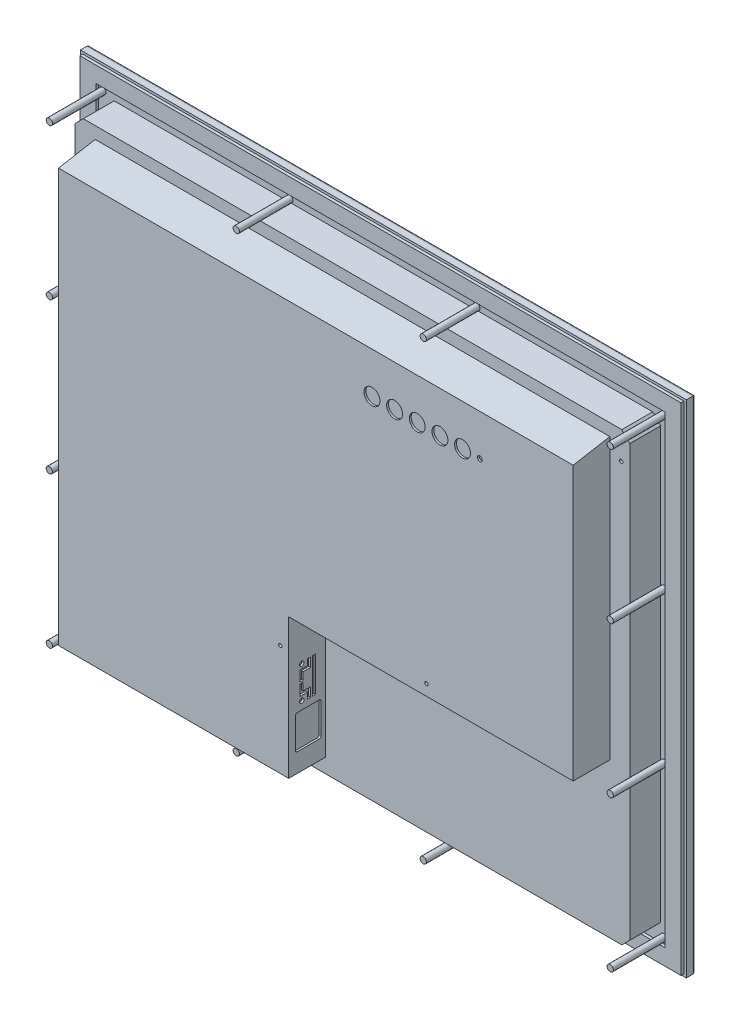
from build123d import *

# Parameters (mm, degrees)
SKETCH1_W                                        = 482.6
SKETCH1_H                                        = 398.78
BEZEL_DEPTH                                      = 7.112
BEZEL_RADIUS_R                                   = 2
SKETCH2_W                                        = 380.8476
SKETCH2_H                                        = 305.6128
WINDOW_DEPTH                                     = 2.35
SKETCH3_W                                        = 478.79
SKETCH3_H                                        = 394.97
SKETCH3_W_2                                      = 453.39
SKETCH3_H_2                                      = 369.57
GASKET_DEPTH                                     = 2.3
SKETCH5_R                                        = 2.5
PANEL_FRAME_STUDS_DEPTH                          = 42.7
BODY_DEPTH                                       = 24.5618
REAR_COVER_DEPTH                                 = 29.21
REAR_COVER_SLOPE_ANGLE                           = 10
SKETCH10_R                                       = 1.5875
VIDEO_TOUCH_INTERFACE_DEPTH                      = 1.524
SKETCH11_R                                       = 1.7907
SKETCH11_W                                       = 2.54
SKETCH11_H                                       = 27.94
POWER_AC_AND_DC_DEPTH                            = 1.524
SKETCH12_R                                       = 6.35
SKETCH12_R_2                                     = 1.9812
CONTROLS_BUTTONS_DEPTH                           = 1.524
F_6_32_ACCESSORY_BRACKET_HOLES_IN_REAR_2_COUNT   = 2
F_6_32_ACCESSORY_BRACKET_HOLES_IN_REAR_2_PITCH   = 120.662672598
F_6_32_ACCESSORY_BRACKET_HOLES_IN_FRAME_AT_COUNT = 2
F_6_32_ACCESSORY_BRACKET_HOLES_IN_FRAME_AT_PITCH = 428.0408
F_6_32_ACCESSORY_BRACKET_HOLES_IN_FRAM_2_COUNT   = 2
F_6_32_ACCESSORY_BRACKET_HOLES_IN_FRAM_2_PITCH   = 529.181678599


with BuildPart() as part:
    # Sketch1 → Bezel (new body)
    with BuildSketch(Plane.XY):
        Rectangle(SKETCH1_W, SKETCH1_H)
    extrude(amount=-BEZEL_DEPTH)

    # Bezel Radius
    bezel_radius_edges = [part.edges().sort_by_distance(p)[0] for p in [
        (241.3, 0, -7.112),
        (0, 199.39, -7.112),
        (-241.3, 0, -7.112),
        (0, -199.39, -7.112),
    ]]
    fillet(bezel_radius_edges, radius=BEZEL_RADIUS_R)

    # Sketch2 → Window (cut)
    with BuildSketch(Plane(origin=(0, 0, -7.112), x_dir=(-1, 0, 0), z_dir=(0, 0, -1))):
        with Locations((0, 2.3114)):
            Rectangle(SKETCH2_W, SKETCH2_H)
    extrude(amount=-WINDOW_DEPTH, mode=Mode.SUBTRACT)

    # Sketch3 → Gasket (add)
    with BuildSketch(Plane.XY):
        Rectangle(SKETCH3_W, SKETCH3_H)
        Rectangle(SKETCH3_W_2, SKETCH3_H_2, mode=Mode.SUBTRACT)
    extrude(amount=GASKET_DEPTH)

    # Sketch5 → Panel Frame Studs (add)
    with BuildSketch(Plane.XY):
        with Locations(Location((-223.3168, 180.1876, 0), (0, 0, 180))):
            Circle(SKETCH5_R)
        with Locations(Location((-223.3168, -180.1876, 0), (0, 0, 180))):
            Circle(SKETCH5_R)
        with Locations(Location((-74.422, 180.1876, 0), (0, 0, 180))):
            Circle(SKETCH5_R)
        with Locations(Location((-74.422, -180.1876, 0), (0, 0, 180))):
            Circle(SKETCH5_R)
        with Locations(Location((-223.3168, 60.0456, 0), (0, 0, 180))):
            Circle(SKETCH5_R)
        with Locations(Location((74.4728, 180.1876, 0), (0, 0, 180))):
            Circle(SKETCH5_R)
        with Locations(Location((74.4728, -180.1876, 0), (0, 0, 180))):
            Circle(SKETCH5_R)
        with Locations(Location((223.3676, 180.1876, 0), (0, 0, 180))):
            Circle(SKETCH5_R)
        with Locations(Location((223.3676, -180.1876, 0), (0, 0, 180))):
            Circle(SKETCH5_R)
        with Locations(Location((223.3676, 60.0456, 0), (0, 0, 180))):
            Circle(SKETCH5_R)
        with Locations(Location((-223.3168, -60.0964, 0), (0, 0, 180))):
            Circle(SKETCH5_R)
        with Locations(Location((223.3676, -60.0964, 0), (0, 0, 180))):
            Circle(SKETCH5_R)
    extrude(amount=PANEL_FRAME_STUDS_DEPTH)


with BuildPart() as body_2:
    # Sketch6 → Body (new body)
    with BuildSketch(Plane.XY):
        Polygon((-220.8168, 171.27569713), (-214.40489713, 177.6876), (214.45569713, 177.6876), (220.8676, 171.27569713), (220.8676, -171.27569713), (214.45569713, -177.6876), (-214.40489713, -177.6876), (-220.8168, -171.27569713), align=None)
    extrude(amount=BODY_DEPTH)

    # Sketch16 → 6-32 Accessory Bracket Holes in Frame (revolve, cut)
    with BuildSketch(Plane(origin=(214.0458, 155.575, 24.5618), x_dir=(0, -1, 0), z_dir=(1, 0, 0))):
        Polygon((0, 0), (0, 16.81469403), (1.35255, 16.002), (1.35255, 0), align=None)
    f_6_32_accessory_bracket_holes_in_frame = revolve(axis=Axis((214.0458, 155.575, 30.9118), (0, 0, -1)), mode=Mode.SUBTRACT)

    # 6-32 Accessory Bracket Holes in Frame at: 6-32 Accessory Bracket Holes in Frame ×2
    with Locations(*[(-i * F_6_32_ACCESSORY_BRACKET_HOLES_IN_FRAME_AT_PITCH, 0, 0) for i in range(1, F_6_32_ACCESSORY_BRACKET_HOLES_IN_FRAME_AT_COUNT)]):
        add(f_6_32_accessory_bracket_holes_in_frame, mode=Mode.SUBTRACT)

    # 6-32 Accessory Bracket Holes in Fram 2: 6-32 Accessory Bracket Holes in Frame ×2
    with Locations(*[Vector(-0.8088730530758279, -0.5879833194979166, 0) * (i * F_6_32_ACCESSORY_BRACKET_HOLES_IN_FRAM_2_PITCH) for i in range(1, F_6_32_ACCESSORY_BRACKET_HOLES_IN_FRAM_2_COUNT)]):
        add(f_6_32_accessory_bracket_holes_in_frame, mode=Mode.SUBTRACT)


with BuildPart() as body_3:
    # Sketch7 → Rear Cover (new body)
    with BuildSketch(Plane.XY.offset(24.5618)):
        Polygon((-204.9272, 168.1226), (204.9272, 168.1226), (204.9272, -54.8386), (-21.59, -54.8386), (-21.59, -166.2938), (-204.9272, -166.2938), align=None)
    extrude(amount=REAR_COVER_DEPTH)

    # Rear Cover Slope
    rear_cover_slope_faces = [body_3.faces().sort_by_distance(p)[0] for p in [
        (0, 168.1226, 39.1668),
    ]]
    draft(rear_cover_slope_faces, Plane.XY.offset(24.5618), REAR_COVER_SLOPE_ANGLE)

    # Sketch10 → Video _ Touch Interface (cut)
    with BuildSketch(Plane(origin=(0, -54.8386, 0), x_dir=(1, 0, 0), z_dir=(0, 1, 0))):
        with Locations((63.517105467, -34.27151993)):
            Circle(SKETCH10_R)
        with Locations((31.005105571, -34.27151993)):
            Circle(SKETCH10_R)
        with Locations((98.930105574, -35.79551993)):
            Circle(SKETCH10_R)
        with Locations((73.930111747, -35.79551993)):
            Circle(SKETCH10_R)
        with Locations((130.435934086, -39.12291993)):
            Circle(SKETCH10_R)
        with Locations((155.435927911, -39.12291993)):
            Circle(SKETCH10_R)
        with BuildLine():
            Line((60.92310861, -36.81151993), (60.92310861, -31.73151993))
            ThreePointArc((60.92310861, -31.73151993), (60.03763367, -29.531815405), (57.875108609, -28.559060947))
            Line((57.875108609, -28.559060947), (36.647102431, -28.559060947))
            ThreePointArc((36.647102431, -28.559060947), (34.48457737, -29.531815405), (33.59910243, -31.73151993))
            Line((33.59910243, -31.73151993), (33.59910243, -36.81151993))
            ThreePointArc((33.59910243, -36.81151993), (34.48457737, -39.011224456), (36.647102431, -39.983978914))
            Line((36.647102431, -39.983978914), (57.875108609, -39.983978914))
            ThreePointArc((57.875108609, -39.983978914), (60.03763367, -39.011224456), (60.92310861, -36.81151993))
        make_face()
        with BuildLine():
            Line((96.590069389, -33.24281993), (96.590069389, -38.32281993))
            ThreePointArc((96.590069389, -38.32281993), (95.704594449, -40.522524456), (93.54206939, -41.495278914))
            Line((93.54206939, -41.495278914), (79.318069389, -41.495278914))
            ThreePointArc((79.318069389, -41.495278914), (77.155544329, -40.522524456), (76.270069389, -38.32281993))
            Line((76.270069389, -38.32281993), (76.270069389, -33.24281993))
            ThreePointArc((76.270069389, -33.24281993), (77.15554433, -31.043115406), (79.318069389, -30.070360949))
            Line((79.318069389, -30.070360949), (93.414497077, -30.067819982))
            ThreePointArc((93.414497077, -30.067819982), (95.659931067, -30.997553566), (96.590069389, -33.24281993))
        make_face()
        with BuildLine():
            Line((132.775891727, -36.595619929), (132.775891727, -41.67561993))
            ThreePointArc((132.775891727, -41.67561993), (133.661366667, -43.875324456), (135.823891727, -44.848078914))
            Line((135.823891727, -44.848078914), (149.920319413, -44.85061988))
            ThreePointArc((149.920319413, -44.85061988), (152.165753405, -43.920886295), (153.095891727, -41.67561993))
            Line((153.095891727, -41.67561993), (153.095891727, -36.59561993))
            ThreePointArc((153.095891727, -36.59561993), (152.210416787, -34.395915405), (150.047891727, -33.423160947))
            Line((150.047891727, -33.423160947), (135.823891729, -33.423160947))
            ThreePointArc((135.823891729, -33.423160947), (133.661366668, -34.395915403), (132.775891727, -36.595619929))
        make_face()
        with BuildLine():
            Line((186.543303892, -33.02691993), (170.541303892, -33.02691993))
            Line((170.541303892, -33.02691993), (170.541303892, -37.53541993))
            Line((170.541303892, -37.53541993), (166.096303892, -37.53541993))
            ThreePointArc((166.096303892, -37.53541993), (164.508803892, -39.12291993), (166.096303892, -40.71041993))
            Line((166.096303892, -40.71041993), (170.541303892, -40.71041993))
            Line((170.541303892, -40.71041993), (170.541303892, -45.21891993))
            Line((170.541303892, -45.21891993), (186.543303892, -45.21891993))
            Line((186.543303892, -45.21891993), (186.543303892, -40.71041993))
            Line((186.543303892, -40.71041993), (190.988303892, -40.71041993))
            ThreePointArc((190.988303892, -40.71041993), (192.575803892, -39.12291993), (190.988303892, -37.53541993))
            Line((190.988303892, -37.53541993), (186.543303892, -37.53541993))
            Line((186.543303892, -37.53541993), (186.543303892, -33.02691993))
        make_face()
    extrude(amount=VIDEO_TOUCH_INTERFACE_DEPTH, mode=Mode.SUBTRACT)

    # Sketch11 → Power AC and DC (cut)
    with BuildSketch(Plane.ZY.offset(21.59)):
        with Locations(Location((43.3832, -117.910996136, 0), (0, 0, 180))):
            Circle(SKETCH11_R)
        with Locations(Location((43.3832, -92.333196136, 0), (0, 0, 180))):
            Circle(SKETCH11_R)
        Polygon((38.8874, -119.092096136), (38.8874, -114.278796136), (44.7802, -114.278796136), (44.7802, -105.884096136), (42.2402, -105.884096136), (42.2402, -111.738796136), (36.3474, -111.738796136), (36.3474, -119.092096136), align=None)
        with Locations((33.5534, -105.122096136)):
            Rectangle(SKETCH11_W, SKETCH11_H)
        Polygon((36.3474, -91.152096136), (38.8874, -91.152096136), (38.8874, -95.965396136), (44.7802, -95.965396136), (44.7802, -104.360096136), (42.2402, -104.360096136), (42.2402, -98.505396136), (36.3474, -98.505396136), align=None)
        with BuildLine():
            Line((28.029143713, -125.82425365), (28.029143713, -149.76375204))
            ThreePointArc((28.029143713, -149.76375204), (28.474959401, -150.840828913), (29.551577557, -151.287751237))
            Line((29.551577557, -151.287751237), (47.002952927, -151.287751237))
            ThreePointArc((47.002952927, -151.287751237), (48.080583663, -150.84138197), (48.526952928, -149.763751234))
            Line((48.526952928, -149.763751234), (48.526952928, -125.824252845))
            ThreePointArc((48.526952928, -125.824252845), (48.08113724, -124.747175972), (47.004519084, -124.30025365))
            Line((47.004519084, -124.30025365), (29.553143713, -124.30025365))
            ThreePointArc((29.553143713, -124.30025365), (28.475512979, -124.746622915), (28.029143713, -125.82425365))
        make_face()
    extrude(amount=POWER_AC_AND_DC_DEPTH, mode=Mode.SUBTRACT)

    # Sketch12 → Controls Buttons (cut)
    with BuildSketch(Plane.XY.offset(53.7718)):
        with Locations((44.704, 130.2512)):
            Circle(SKETCH12_R)
        with Locations((62.738, 130.2512)):
            Circle(SKETCH12_R)
        with Locations((80.772, 130.2512)):
            Circle(SKETCH12_R)
        with Locations((98.806, 130.2512)):
            Circle(SKETCH12_R)
        with Locations((130.556, 130.2512)):
            Circle(SKETCH12_R_2)
        with Locations((116.84, 130.2512)):
            Circle(SKETCH12_R)
    extrude(amount=-CONTROLS_BUTTONS_DEPTH, mode=Mode.SUBTRACT)

    # Sketch14 → 6-32 Accessory Bracket Holes in Rear Cov (revolve, cut)
    with BuildSketch(Plane(origin=(-28.2956, -77.9272, 53.7718), x_dir=(0, -1, 0), z_dir=(1, 0, 0))):
        Polygon((0, 0), (0, 16.81469403), (1.35255, 16.002), (1.35255, 0), align=None)
    f_6_32_accessory_bracket_holes_in_rear_cov = revolve(axis=Axis((-28.2956, -77.9272, 60.1218), (0, 0, -1)), mode=Mode.SUBTRACT)

    # 6-32 Accessory Bracket Holes in Rear 2: 6-32 Accessory Bracket Holes in Rear Cov ×2
    with Locations(*[Vector(0.9645302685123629, 0.2639722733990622, 0) * (i * F_6_32_ACCESSORY_BRACKET_HOLES_IN_REAR_2_PITCH) for i in range(1, F_6_32_ACCESSORY_BRACKET_HOLES_IN_REAR_2_COUNT)]):
        add(f_6_32_accessory_bracket_holes_in_rear_cov, mode=Mode.SUBTRACT)


solid = Compound([part.part, body_2.part, body_3.part])
